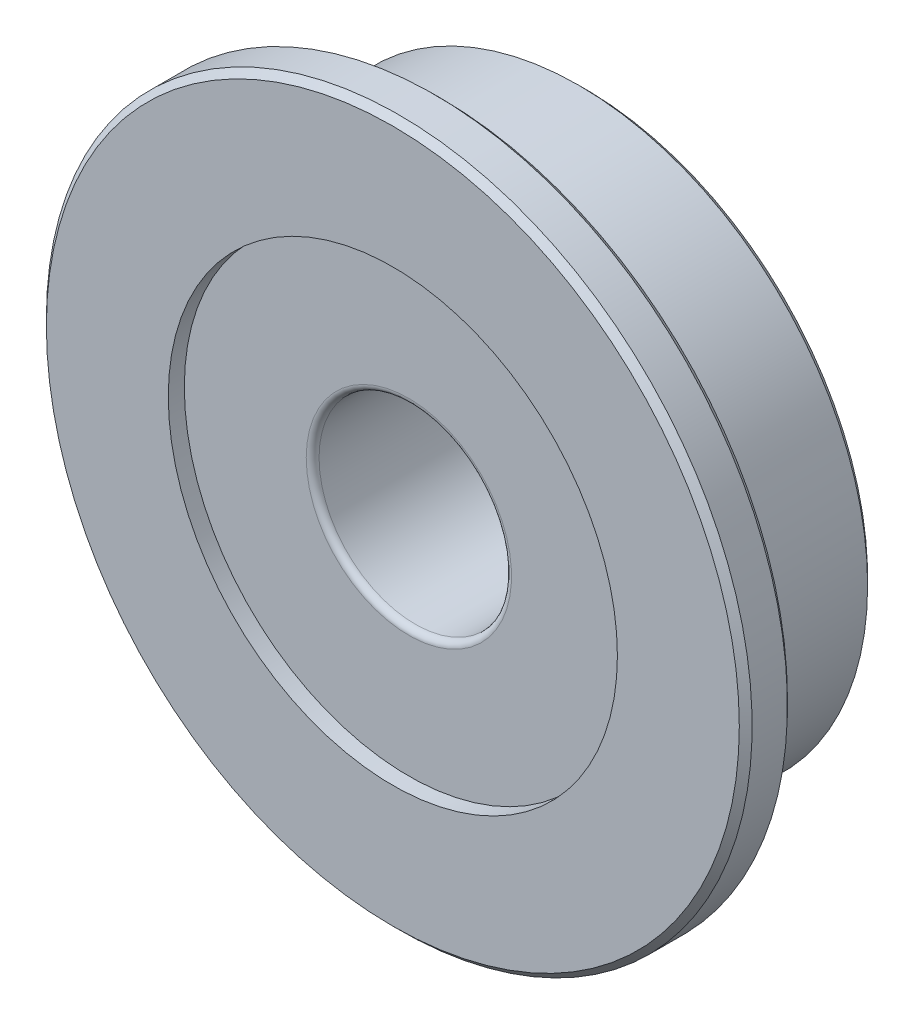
ISO-10303-21;
HEADER;
FILE_DESCRIPTION(('STEP AP214'),'2;1');
FILE_NAME('part.step','',(''),(''),'','','');
FILE_SCHEMA(('AUTOMOTIVE_DESIGN { 1 0 10303 214 1 1 1 1 }'));
ENDSEC;
DATA;
#1=APPLICATION_CONTEXT('core data for automotive mechanical design processes');
#2=APPLICATION_PROTOCOL_DEFINITION('international standard','automotive_design',2000,#1);
#3=PRODUCT_CONTEXT('',#1,'mechanical');
#4=PRODUCT('Part','Part','',(#3));
#5=PRODUCT_RELATED_PRODUCT_CATEGORY('part','',(#4));
#6=PRODUCT_DEFINITION_FORMATION('','',#4);
#7=PRODUCT_DEFINITION_CONTEXT('part definition',#1,'design');
#8=PRODUCT_DEFINITION('design','',#6,#7);
#9=PRODUCT_DEFINITION_SHAPE('','',#8);
#10=(LENGTH_UNIT() NAMED_UNIT(*) SI_UNIT(.MILLI.,.METRE.));
#11=(NAMED_UNIT(*) PLANE_ANGLE_UNIT() SI_UNIT($,.RADIAN.));
#12=(NAMED_UNIT(*) SI_UNIT($,.STERADIAN.) SOLID_ANGLE_UNIT());
#13=UNCERTAINTY_MEASURE_WITH_UNIT(LENGTH_MEASURE(1.E-05),#10,'distance_accuracy_value','');
#14=(GEOMETRIC_REPRESENTATION_CONTEXT(3) GLOBAL_UNCERTAINTY_ASSIGNED_CONTEXT((#13)) GLOBAL_UNIT_ASSIGNED_CONTEXT((#10,
#11,#12)) REPRESENTATION_CONTEXT('',''));
#15=CARTESIAN_POINT('',(0.,0.,0.));
#16=DIRECTION('',(0.,0.,1.));
#17=DIRECTION('',(1.,0.,0.));
#18=AXIS2_PLACEMENT_3D('',#15,#16,#17);
#19=CARTESIAN_POINT('',(0.,0.,2.3));
#20=DIRECTION('',(0.,0.,-1.));
#21=DIRECTION('',(-1.,0.,0.));
#22=AXIS2_PLACEMENT_3D('',#19,#20,#21);
#23=TOROIDAL_SURFACE('',#22,3.2,0.200000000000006);
#24=CARTESIAN_POINT('',(0.,0.,2.3));
#25=DIRECTION('',(0.,0.,-1.));
#26=DIRECTION('',(-1.,0.,0.));
#27=AXIS2_PLACEMENT_3D('',#24,#25,#26);
#28=CIRCLE('',#27,3.);
#29=CARTESIAN_POINT('',(-3.,0.,2.3));
#30=VERTEX_POINT('',#29);
#31=EDGE_CURVE('E61',#30,#30,#28,.T.);
#32=ORIENTED_EDGE('',*,*,#31,.T.);
#33=EDGE_LOOP('',(#32));
#34=FACE_BOUND('',#33,.T.);
#35=CARTESIAN_POINT('',(0.,0.,2.5));
#36=DIRECTION('',(0.,0.,-1.));
#37=DIRECTION('',(-1.,0.,0.));
#38=AXIS2_PLACEMENT_3D('',#35,#36,#37);
#39=CIRCLE('',#38,3.2);
#40=CARTESIAN_POINT('',(-3.2,0.,2.5));
#41=VERTEX_POINT('',#40);
#42=EDGE_CURVE('E8',#41,#41,#39,.T.);
#43=ORIENTED_EDGE('',*,*,#42,.F.);
#44=EDGE_LOOP('',(#43));
#45=FACE_BOUND('',#44,.T.);
#46=ADVANCED_FACE('F12',(#34,#45),#23,.T.);
#47=CARTESIAN_POINT('',(0.,3.2,2.5));
#48=DIRECTION('',(0.,0.,1.));
#49=DIRECTION('',(1.,0.,0.));
#50=AXIS2_PLACEMENT_3D('',#47,#48,#49);
#51=PLANE('',#50);
#52=ORIENTED_EDGE('',*,*,#42,.T.);
#53=EDGE_LOOP('',(#52));
#54=FACE_BOUND('',#53,.T.);
#55=CARTESIAN_POINT('',(0.,0.,2.5));
#56=DIRECTION('',(0.,0.,-1.));
#57=DIRECTION('',(-1.,0.,0.));
#58=AXIS2_PLACEMENT_3D('',#55,#56,#57);
#59=CIRCLE('',#58,7.);
#60=CARTESIAN_POINT('',(-7.,0.,2.5));
#61=VERTEX_POINT('',#60);
#62=EDGE_CURVE('E18',#61,#61,#59,.T.);
#63=ORIENTED_EDGE('',*,*,#62,.F.);
#64=EDGE_LOOP('',(#63));
#65=FACE_BOUND('',#64,.T.);
#66=ADVANCED_FACE('F81',(#54,#65),#51,.T.);
#67=CARTESIAN_POINT('',(0.,0.,-6.));
#68=DIRECTION('',(0.,0.,-1.));
#69=DIRECTION('',(-1.,0.,0.));
#70=AXIS2_PLACEMENT_3D('',#67,#68,#69);
#71=CYLINDRICAL_SURFACE('',#70,7.);
#72=ORIENTED_EDGE('',*,*,#62,.T.);
#73=EDGE_LOOP('',(#72));
#74=FACE_BOUND('',#73,.T.);
#75=CARTESIAN_POINT('',(0.,0.,3.));
#76=DIRECTION('',(0.,0.,-1.));
#77=DIRECTION('',(-1.,0.,0.));
#78=AXIS2_PLACEMENT_3D('',#75,#76,#77);
#79=CIRCLE('',#78,7.);
#80=CARTESIAN_POINT('',(-7.,0.,3.));
#81=VERTEX_POINT('',#80);
#82=EDGE_CURVE('E22',#81,#81,#79,.T.);
#83=ORIENTED_EDGE('',*,*,#82,.F.);
#84=EDGE_LOOP('',(#83));
#85=FACE_BOUND('',#84,.T.);
#86=ADVANCED_FACE('F86',(#74,#85),#71,.F.);
#87=CARTESIAN_POINT('',(0.,10.8,3.));
#88=DIRECTION('',(0.,0.,1.));
#89=DIRECTION('',(1.,0.,0.));
#90=AXIS2_PLACEMENT_3D('',#87,#88,#89);
#91=PLANE('',#90);
#92=ORIENTED_EDGE('',*,*,#82,.T.);
#93=EDGE_LOOP('',(#92));
#94=FACE_BOUND('',#93,.T.);
#95=CARTESIAN_POINT('',(0.,0.,3.));
#96=DIRECTION('',(0.,0.,-1.));
#97=DIRECTION('',(-1.,0.,0.));
#98=AXIS2_PLACEMENT_3D('',#95,#96,#97);
#99=CIRCLE('',#98,10.8);
#100=CARTESIAN_POINT('',(-10.8,0.,3.));
#101=VERTEX_POINT('',#100);
#102=EDGE_CURVE('E26',#101,#101,#99,.T.);
#103=ORIENTED_EDGE('',*,*,#102,.F.);
#104=EDGE_LOOP('',(#103));
#105=FACE_BOUND('',#104,.T.);
#106=ADVANCED_FACE('F91',(#94,#105),#91,.T.);
#107=CARTESIAN_POINT('',(0.,0.,2.8));
#108=DIRECTION('',(0.,0.,-1.));
#109=DIRECTION('',(-1.,0.,0.));
#110=AXIS2_PLACEMENT_3D('',#107,#108,#109);
#111=CONICAL_SURFACE('',#110,11.,0.785398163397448);
#112=ORIENTED_EDGE('',*,*,#102,.T.);
#113=EDGE_LOOP('',(#112));
#114=FACE_BOUND('',#113,.T.);
#115=CARTESIAN_POINT('',(0.,0.,2.8));
#116=DIRECTION('',(0.,0.,-1.));
#117=DIRECTION('',(-1.,0.,0.));
#118=AXIS2_PLACEMENT_3D('',#115,#116,#117);
#119=CIRCLE('',#118,11.);
#120=CARTESIAN_POINT('',(-11.,0.,2.8));
#121=VERTEX_POINT('',#120);
#122=EDGE_CURVE('E31',#121,#121,#119,.T.);
#123=ORIENTED_EDGE('',*,*,#122,.F.);
#124=EDGE_LOOP('',(#123));
#125=FACE_BOUND('',#124,.T.);
#126=ADVANCED_FACE('F97',(#114,#125),#111,.T.);
#127=CARTESIAN_POINT('',(0.,0.,-6.));
#128=DIRECTION('',(0.,0.,-1.));
#129=DIRECTION('',(-1.,0.,0.));
#130=AXIS2_PLACEMENT_3D('',#127,#128,#129);
#131=CYLINDRICAL_SURFACE('',#130,11.);
#132=ORIENTED_EDGE('',*,*,#122,.T.);
#133=EDGE_LOOP('',(#132));
#134=FACE_BOUND('',#133,.T.);
#135=CARTESIAN_POINT('',(0.,0.,1.7));
#136=DIRECTION('',(0.,0.,-1.));
#137=DIRECTION('',(-1.,0.,0.));
#138=AXIS2_PLACEMENT_3D('',#135,#136,#137);
#139=CIRCLE('',#138,11.);
#140=CARTESIAN_POINT('',(-11.,0.,1.7));
#141=VERTEX_POINT('',#140);
#142=EDGE_CURVE('E34',#141,#141,#139,.T.);
#143=ORIENTED_EDGE('',*,*,#142,.F.);
#144=EDGE_LOOP('',(#143));
#145=FACE_BOUND('',#144,.T.);
#146=ADVANCED_FACE('F101',(#134,#145),#131,.T.);
#147=CARTESIAN_POINT('',(0.,0.,1.5));
#148=DIRECTION('',(0.,0.,1.));
#149=DIRECTION('',(1.,0.,0.));
#150=AXIS2_PLACEMENT_3D('',#147,#148,#149);
#151=CONICAL_SURFACE('',#150,10.8,0.785398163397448);
#152=ORIENTED_EDGE('',*,*,#142,.T.);
#153=EDGE_LOOP('',(#152));
#154=FACE_BOUND('',#153,.T.);
#155=CARTESIAN_POINT('',(0.,0.,1.5));
#156=DIRECTION('',(0.,0.,-1.));
#157=DIRECTION('',(-1.,0.,0.));
#158=AXIS2_PLACEMENT_3D('',#155,#156,#157);
#159=CIRCLE('',#158,10.8);
#160=CARTESIAN_POINT('',(-10.8,0.,1.5));
#161=VERTEX_POINT('',#160);
#162=EDGE_CURVE('E37',#161,#161,#159,.T.);
#163=ORIENTED_EDGE('',*,*,#162,.F.);
#164=EDGE_LOOP('',(#163));
#165=FACE_BOUND('',#164,.T.);
#166=ADVANCED_FACE('F105',(#154,#165),#151,.T.);
#167=CARTESIAN_POINT('',(0.,10.8,1.5));
#168=DIRECTION('',(0.,0.,-1.));
#169=DIRECTION('',(-1.,0.,0.));
#170=AXIS2_PLACEMENT_3D('',#167,#168,#169);
#171=PLANE('',#170);
#172=ORIENTED_EDGE('',*,*,#162,.T.);
#173=EDGE_LOOP('',(#172));
#174=FACE_BOUND('',#173,.T.);
#175=CARTESIAN_POINT('',(0.,0.,1.5));
#176=DIRECTION('',(0.,0.,-1.));
#177=DIRECTION('',(-1.,0.,0.));
#178=AXIS2_PLACEMENT_3D('',#175,#176,#177);
#179=CIRCLE('',#178,9.);
#180=CARTESIAN_POINT('',(-9.,0.,1.5));
#181=VERTEX_POINT('',#180);
#182=EDGE_CURVE('E40',#181,#181,#179,.T.);
#183=ORIENTED_EDGE('',*,*,#182,.F.);
#184=EDGE_LOOP('',(#183));
#185=FACE_BOUND('',#184,.T.);
#186=ADVANCED_FACE('F109',(#174,#185),#171,.T.);
#187=CARTESIAN_POINT('',(0.,0.,-6.));
#188=DIRECTION('',(0.,0.,-1.));
#189=DIRECTION('',(-1.,0.,0.));
#190=AXIS2_PLACEMENT_3D('',#187,#188,#189);
#191=CYLINDRICAL_SURFACE('',#190,9.);
#192=ORIENTED_EDGE('',*,*,#182,.T.);
#193=EDGE_LOOP('',(#192));
#194=FACE_BOUND('',#193,.T.);
#195=CARTESIAN_POINT('',(0.,0.,-2.8));
#196=DIRECTION('',(0.,0.,-1.));
#197=DIRECTION('',(-1.,0.,0.));
#198=AXIS2_PLACEMENT_3D('',#195,#196,#197);
#199=CIRCLE('',#198,9.);
#200=CARTESIAN_POINT('',(-9.,0.,-2.8));
#201=VERTEX_POINT('',#200);
#202=EDGE_CURVE('E43',#201,#201,#199,.T.);
#203=ORIENTED_EDGE('',*,*,#202,.F.);
#204=EDGE_LOOP('',(#203));
#205=FACE_BOUND('',#204,.T.);
#206=ADVANCED_FACE('F113',(#194,#205),#191,.T.);
#207=CARTESIAN_POINT('',(0.,0.,-3.));
#208=DIRECTION('',(0.,0.,1.));
#209=DIRECTION('',(1.,0.,0.));
#210=AXIS2_PLACEMENT_3D('',#207,#208,#209);
#211=CONICAL_SURFACE('',#210,8.8,0.785398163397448);
#212=ORIENTED_EDGE('',*,*,#202,.T.);
#213=EDGE_LOOP('',(#212));
#214=FACE_BOUND('',#213,.T.);
#215=CARTESIAN_POINT('',(0.,0.,-3.));
#216=DIRECTION('',(0.,0.,-1.));
#217=DIRECTION('',(-1.,0.,0.));
#218=AXIS2_PLACEMENT_3D('',#215,#216,#217);
#219=CIRCLE('',#218,8.8);
#220=CARTESIAN_POINT('',(-8.8,0.,-3.));
#221=VERTEX_POINT('',#220);
#222=EDGE_CURVE('E46',#221,#221,#219,.T.);
#223=ORIENTED_EDGE('',*,*,#222,.F.);
#224=EDGE_LOOP('',(#223));
#225=FACE_BOUND('',#224,.T.);
#226=ADVANCED_FACE('F117',(#214,#225),#211,.T.);
#227=CARTESIAN_POINT('',(0.,7.,-3.));
#228=DIRECTION('',(0.,0.,-1.));
#229=DIRECTION('',(-1.,0.,0.));
#230=AXIS2_PLACEMENT_3D('',#227,#228,#229);
#231=PLANE('',#230);
#232=ORIENTED_EDGE('',*,*,#222,.T.);
#233=EDGE_LOOP('',(#232));
#234=FACE_BOUND('',#233,.T.);
#235=CARTESIAN_POINT('',(0.,0.,-3.));
#236=DIRECTION('',(0.,0.,-1.));
#237=DIRECTION('',(-1.,0.,0.));
#238=AXIS2_PLACEMENT_3D('',#235,#236,#237);
#239=CIRCLE('',#238,7.);
#240=CARTESIAN_POINT('',(-7.,0.,-3.));
#241=VERTEX_POINT('',#240);
#242=EDGE_CURVE('E49',#241,#241,#239,.T.);
#243=ORIENTED_EDGE('',*,*,#242,.F.);
#244=EDGE_LOOP('',(#243));
#245=FACE_BOUND('',#244,.T.);
#246=ADVANCED_FACE('F121',(#234,#245),#231,.T.);
#247=CARTESIAN_POINT('',(0.,0.,-6.));
#248=DIRECTION('',(0.,0.,-1.));
#249=DIRECTION('',(-1.,0.,0.));
#250=AXIS2_PLACEMENT_3D('',#247,#248,#249);
#251=CYLINDRICAL_SURFACE('',#250,7.);
#252=ORIENTED_EDGE('',*,*,#242,.T.);
#253=EDGE_LOOP('',(#252));
#254=FACE_BOUND('',#253,.T.);
#255=CARTESIAN_POINT('',(0.,0.,-2.5));
#256=DIRECTION('',(0.,0.,-1.));
#257=DIRECTION('',(-1.,0.,0.));
#258=AXIS2_PLACEMENT_3D('',#255,#256,#257);
#259=CIRCLE('',#258,7.);
#260=CARTESIAN_POINT('',(-7.,0.,-2.5));
#261=VERTEX_POINT('',#260);
#262=EDGE_CURVE('E52',#261,#261,#259,.T.);
#263=ORIENTED_EDGE('',*,*,#262,.F.);
#264=EDGE_LOOP('',(#263));
#265=FACE_BOUND('',#264,.T.);
#266=ADVANCED_FACE('F125',(#254,#265),#251,.F.);
#267=CARTESIAN_POINT('',(0.,3.2,-2.5));
#268=DIRECTION('',(0.,0.,-1.));
#269=DIRECTION('',(-1.,0.,0.));
#270=AXIS2_PLACEMENT_3D('',#267,#268,#269);
#271=PLANE('',#270);
#272=ORIENTED_EDGE('',*,*,#262,.T.);
#273=EDGE_LOOP('',(#272));
#274=FACE_BOUND('',#273,.T.);
#275=CARTESIAN_POINT('',(0.,0.,-2.5));
#276=DIRECTION('',(0.,0.,-1.));
#277=DIRECTION('',(-1.,0.,0.));
#278=AXIS2_PLACEMENT_3D('',#275,#276,#277);
#279=CIRCLE('',#278,3.2);
#280=CARTESIAN_POINT('',(-3.2,0.,-2.5));
#281=VERTEX_POINT('',#280);
#282=EDGE_CURVE('E55',#281,#281,#279,.T.);
#283=ORIENTED_EDGE('',*,*,#282,.F.);
#284=EDGE_LOOP('',(#283));
#285=FACE_BOUND('',#284,.T.);
#286=ADVANCED_FACE('F77',(#274,#285),#271,.T.);
#287=CARTESIAN_POINT('',(0.,0.,-2.3));
#288=DIRECTION('',(0.,0.,-1.));
#289=DIRECTION('',(-1.,0.,0.));
#290=AXIS2_PLACEMENT_3D('',#287,#288,#289);
#291=TOROIDAL_SURFACE('',#290,3.2,0.200000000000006);
#292=ORIENTED_EDGE('',*,*,#282,.T.);
#293=EDGE_LOOP('',(#292));
#294=FACE_BOUND('',#293,.T.);
#295=CARTESIAN_POINT('',(0.,0.,-2.3));
#296=DIRECTION('',(0.,0.,-1.));
#297=DIRECTION('',(-1.,0.,0.));
#298=AXIS2_PLACEMENT_3D('',#295,#296,#297);
#299=CIRCLE('',#298,3.);
#300=CARTESIAN_POINT('',(-3.,0.,-2.3));
#301=VERTEX_POINT('',#300);
#302=EDGE_CURVE('E58',#301,#301,#299,.T.);
#303=ORIENTED_EDGE('',*,*,#302,.F.);
#304=EDGE_LOOP('',(#303));
#305=FACE_BOUND('',#304,.T.);
#306=ADVANCED_FACE('F69',(#294,#305),#291,.T.);
#307=CARTESIAN_POINT('',(0.,0.,-6.));
#308=DIRECTION('',(0.,0.,-1.));
#309=DIRECTION('',(-1.,0.,0.));
#310=AXIS2_PLACEMENT_3D('',#307,#308,#309);
#311=CYLINDRICAL_SURFACE('',#310,3.);
#312=ORIENTED_EDGE('',*,*,#302,.T.);
#313=EDGE_LOOP('',(#312));
#314=FACE_BOUND('',#313,.T.);
#315=ORIENTED_EDGE('',*,*,#31,.F.);
#316=EDGE_LOOP('',(#315));
#317=FACE_BOUND('',#316,.T.);
#318=ADVANCED_FACE('F67',(#314,#317),#311,.F.);
#319=CLOSED_SHELL('',(#46,#66,#86,#106,#126,#146,#166,#186,#206,#226,#246,#266,#286,#306,#318));
#320=MANIFOLD_SOLID_BREP('B1',#319);
#321=ADVANCED_BREP_SHAPE_REPRESENTATION('',(#18,#320),#14);
#322=SHAPE_DEFINITION_REPRESENTATION(#9,#321);
ENDSEC;
END-ISO-10303-21;
